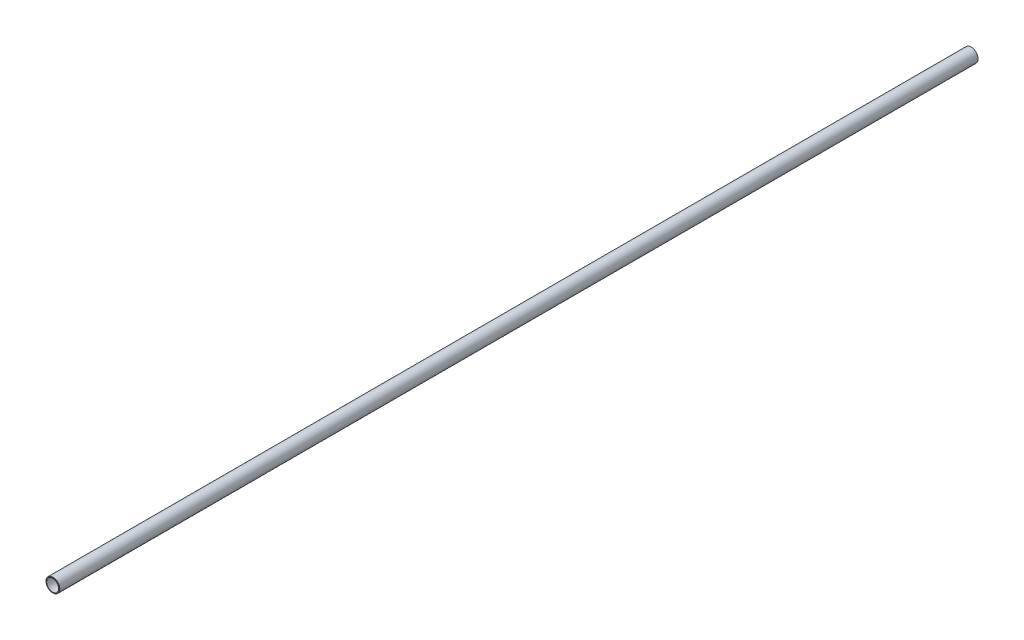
ISO-10303-21;
HEADER;
FILE_DESCRIPTION(('STEP AP214'),'2;1');
FILE_NAME('part.step','',(''),(''),'','','');
FILE_SCHEMA(('AUTOMOTIVE_DESIGN { 1 0 10303 214 1 1 1 1 }'));
ENDSEC;
DATA;
#1=APPLICATION_CONTEXT('core data for automotive mechanical design processes');
#2=APPLICATION_PROTOCOL_DEFINITION('international standard','automotive_design',2000,#1);
#3=PRODUCT_CONTEXT('',#1,'mechanical');
#4=PRODUCT('Part','Part','',(#3));
#5=PRODUCT_RELATED_PRODUCT_CATEGORY('part','',(#4));
#6=PRODUCT_DEFINITION_FORMATION('','',#4);
#7=PRODUCT_DEFINITION_CONTEXT('part definition',#1,'design');
#8=PRODUCT_DEFINITION('design','',#6,#7);
#9=PRODUCT_DEFINITION_SHAPE('','',#8);
#10=(LENGTH_UNIT() NAMED_UNIT(*) SI_UNIT(.MILLI.,.METRE.));
#11=(NAMED_UNIT(*) PLANE_ANGLE_UNIT() SI_UNIT($,.RADIAN.));
#12=(NAMED_UNIT(*) SI_UNIT($,.STERADIAN.) SOLID_ANGLE_UNIT());
#13=UNCERTAINTY_MEASURE_WITH_UNIT(LENGTH_MEASURE(1.E-05),#10,'distance_accuracy_value','');
#14=(GEOMETRIC_REPRESENTATION_CONTEXT(3) GLOBAL_UNCERTAINTY_ASSIGNED_CONTEXT((#13)) GLOBAL_UNIT_ASSIGNED_CONTEXT((#10,
#11,#12)) REPRESENTATION_CONTEXT('',''));
#15=CARTESIAN_POINT('',(0.,0.,0.));
#16=DIRECTION('',(0.,0.,1.));
#17=DIRECTION('',(1.,0.,0.));
#18=AXIS2_PLACEMENT_3D('',#15,#16,#17);
#19=CARTESIAN_POINT('',(0.,0.,2000.));
#20=DIRECTION('',(0.,0.,1.));
#21=DIRECTION('',(1.,0.,0.));
#22=AXIS2_PLACEMENT_3D('',#19,#20,#21);
#23=PLANE('',#22);
#24=CARTESIAN_POINT('',(0.,0.,2000.));
#25=DIRECTION('',(0.,0.,1.));
#26=DIRECTION('',(1.,0.,0.));
#27=AXIS2_PLACEMENT_3D('',#24,#25,#26);
#28=CIRCLE('',#27,14.4999999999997);
#29=CARTESIAN_POINT('',(14.4999999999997,0.,2000.));
#30=VERTEX_POINT('',#29);
#31=EDGE_CURVE('E46',#30,#30,#28,.T.);
#32=ORIENTED_EDGE('',*,*,#31,.T.);
#33=EDGE_LOOP('',(#32));
#34=FACE_BOUND('',#33,.T.);
#35=CARTESIAN_POINT('',(0.,0.,2000.));
#36=DIRECTION('',(0.,0.,1.));
#37=DIRECTION('',(1.,0.,0.));
#38=AXIS2_PLACEMENT_3D('',#35,#36,#37);
#39=CIRCLE('',#38,13.);
#40=CARTESIAN_POINT('',(13.,0.,2000.));
#41=VERTEX_POINT('',#40);
#42=EDGE_CURVE('E51',#41,#41,#39,.T.);
#43=ORIENTED_EDGE('',*,*,#42,.F.);
#44=EDGE_LOOP('',(#43));
#45=FACE_BOUND('',#44,.T.);
#46=ADVANCED_FACE('F31',(#34,#45),#23,.T.);
#47=CARTESIAN_POINT('',(0.,0.,0.));
#48=DIRECTION('',(0.,0.,1.));
#49=DIRECTION('',(1.,0.,0.));
#50=AXIS2_PLACEMENT_3D('',#47,#48,#49);
#51=PLANE('',#50);
#52=CARTESIAN_POINT('',(0.,0.,0.));
#53=DIRECTION('',(0.,0.,1.));
#54=DIRECTION('',(1.,0.,0.));
#55=AXIS2_PLACEMENT_3D('',#52,#53,#54);
#56=CIRCLE('',#55,14.5000000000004);
#57=CARTESIAN_POINT('',(14.5000000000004,0.,0.));
#58=VERTEX_POINT('',#57);
#59=EDGE_CURVE('E10',#58,#58,#56,.F.);
#60=ORIENTED_EDGE('',*,*,#59,.T.);
#61=EDGE_LOOP('',(#60));
#62=FACE_BOUND('',#61,.T.);
#63=CARTESIAN_POINT('',(0.,0.,0.));
#64=DIRECTION('',(0.,0.,1.));
#65=DIRECTION('',(1.,0.,0.));
#66=AXIS2_PLACEMENT_3D('',#63,#64,#65);
#67=CIRCLE('',#66,13.);
#68=CARTESIAN_POINT('',(13.,0.,0.));
#69=VERTEX_POINT('',#68);
#70=EDGE_CURVE('E52',#69,#69,#67,.T.);
#71=ORIENTED_EDGE('',*,*,#70,.T.);
#72=EDGE_LOOP('',(#71));
#73=FACE_BOUND('',#72,.T.);
#74=ADVANCED_FACE('F62',(#62,#73),#51,.F.);
#75=CARTESIAN_POINT('',(0.,0.,2000.));
#76=DIRECTION('',(0.,0.,-1.));
#77=DIRECTION('',(-1.,0.,0.));
#78=AXIS2_PLACEMENT_3D('',#75,#76,#77);
#79=CYLINDRICAL_SURFACE('',#78,15.);
#80=CARTESIAN_POINT('',(0.,0.,1999.5));
#81=DIRECTION('',(0.,0.,1.));
#82=DIRECTION('',(1.,0.,0.));
#83=AXIS2_PLACEMENT_3D('',#80,#81,#82);
#84=CIRCLE('',#83,15.);
#85=CARTESIAN_POINT('',(15.,0.,1999.5));
#86=VERTEX_POINT('',#85);
#87=EDGE_CURVE('E38',#86,#86,#84,.F.);
#88=ORIENTED_EDGE('',*,*,#87,.T.);
#89=EDGE_LOOP('',(#88));
#90=FACE_BOUND('',#89,.T.);
#91=CARTESIAN_POINT('',(0.,0.,0.499999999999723));
#92=DIRECTION('',(0.,0.,1.));
#93=DIRECTION('',(1.,0.,0.));
#94=AXIS2_PLACEMENT_3D('',#91,#92,#93);
#95=CIRCLE('',#94,15.);
#96=CARTESIAN_POINT('',(15.,0.,0.499999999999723));
#97=VERTEX_POINT('',#96);
#98=EDGE_CURVE('E42',#97,#97,#95,.T.);
#99=ORIENTED_EDGE('',*,*,#98,.T.);
#100=EDGE_LOOP('',(#99));
#101=FACE_BOUND('',#100,.T.);
#102=ADVANCED_FACE('F68',(#90,#101),#79,.T.);
#103=CARTESIAN_POINT('',(0.,0.,2000.));
#104=DIRECTION('',(0.,0.,-1.));
#105=DIRECTION('',(-1.,0.,0.));
#106=AXIS2_PLACEMENT_3D('',#103,#104,#105);
#107=CYLINDRICAL_SURFACE('',#106,13.);
#108=ORIENTED_EDGE('',*,*,#42,.T.);
#109=EDGE_LOOP('',(#108));
#110=FACE_BOUND('',#109,.T.);
#111=ORIENTED_EDGE('',*,*,#70,.F.);
#112=EDGE_LOOP('',(#111));
#113=FACE_BOUND('',#112,.T.);
#114=ADVANCED_FACE('F58',(#110,#113),#107,.F.);
#115=CARTESIAN_POINT('',(0.,0.,2000.));
#116=DIRECTION('',(0.,0.,-1.));
#117=DIRECTION('',(-1.,0.,0.));
#118=AXIS2_PLACEMENT_3D('',#115,#116,#117);
#119=CONICAL_SURFACE('',#118,14.4999999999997,0.785398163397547);
#120=ORIENTED_EDGE('',*,*,#87,.F.);
#121=EDGE_LOOP('',(#120));
#122=FACE_BOUND('',#121,.T.);
#123=ORIENTED_EDGE('',*,*,#31,.F.);
#124=EDGE_LOOP('',(#123));
#125=FACE_BOUND('',#124,.T.);
#126=ADVANCED_FACE('F73',(#122,#125),#119,.T.);
#127=CARTESIAN_POINT('',(0.,0.,0.499999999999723));
#128=DIRECTION('',(0.,0.,1.));
#129=DIRECTION('',(1.,0.,0.));
#130=AXIS2_PLACEMENT_3D('',#127,#128,#129);
#131=CONICAL_SURFACE('',#130,15.,0.785398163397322);
#132=ORIENTED_EDGE('',*,*,#59,.F.);
#133=EDGE_LOOP('',(#132));
#134=FACE_BOUND('',#133,.T.);
#135=ORIENTED_EDGE('',*,*,#98,.F.);
#136=EDGE_LOOP('',(#135));
#137=FACE_BOUND('',#136,.T.);
#138=ADVANCED_FACE('F33',(#134,#137),#131,.T.);
#139=CLOSED_SHELL('',(#46,#74,#102,#114,#126,#138));
#140=MANIFOLD_SOLID_BREP('B2',#139);
#141=ADVANCED_BREP_SHAPE_REPRESENTATION('',(#18,#140),#14);
#142=SHAPE_DEFINITION_REPRESENTATION(#9,#141);
ENDSEC;
END-ISO-10303-21;
